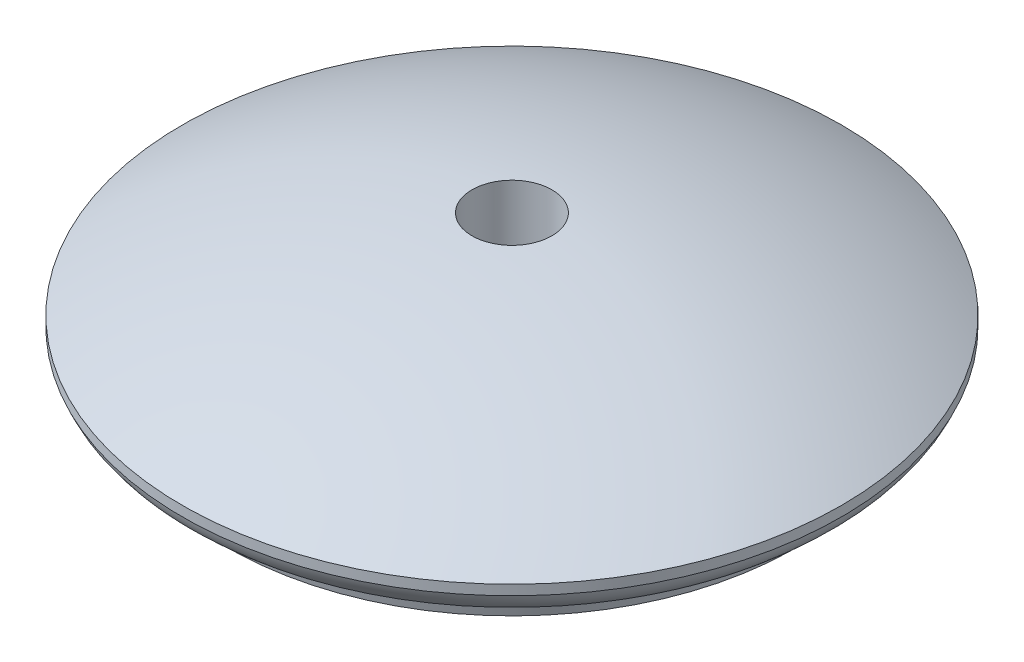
ISO-10303-21;
HEADER;
FILE_DESCRIPTION(('STEP AP214'),'2;1');
FILE_NAME('part.step','',(''),(''),'','','');
FILE_SCHEMA(('AUTOMOTIVE_DESIGN { 1 0 10303 214 1 1 1 1 }'));
ENDSEC;
DATA;
#1=APPLICATION_CONTEXT('core data for automotive mechanical design processes');
#2=APPLICATION_PROTOCOL_DEFINITION('international standard','automotive_design',2000,#1);
#3=PRODUCT_CONTEXT('',#1,'mechanical');
#4=PRODUCT('Part','Part','',(#3));
#5=PRODUCT_RELATED_PRODUCT_CATEGORY('part','',(#4));
#6=PRODUCT_DEFINITION_FORMATION('','',#4);
#7=PRODUCT_DEFINITION_CONTEXT('part definition',#1,'design');
#8=PRODUCT_DEFINITION('design','',#6,#7);
#9=PRODUCT_DEFINITION_SHAPE('','',#8);
#10=(LENGTH_UNIT() NAMED_UNIT(*) SI_UNIT(.MILLI.,.METRE.));
#11=(NAMED_UNIT(*) PLANE_ANGLE_UNIT() SI_UNIT($,.RADIAN.));
#12=(NAMED_UNIT(*) SI_UNIT($,.STERADIAN.) SOLID_ANGLE_UNIT());
#13=UNCERTAINTY_MEASURE_WITH_UNIT(LENGTH_MEASURE(1.E-05),#10,'distance_accuracy_value','');
#14=(GEOMETRIC_REPRESENTATION_CONTEXT(3) GLOBAL_UNCERTAINTY_ASSIGNED_CONTEXT((#13)) GLOBAL_UNIT_ASSIGNED_CONTEXT((#10,
#11,#12)) REPRESENTATION_CONTEXT('',''));
#15=CARTESIAN_POINT('',(0.,0.,0.));
#16=DIRECTION('',(0.,0.,1.));
#17=DIRECTION('',(1.,0.,0.));
#18=AXIS2_PLACEMENT_3D('',#15,#16,#17);
#19=CARTESIAN_POINT('',(0.,0.,0.));
#20=DIRECTION('',(0.,-1.,0.));
#21=DIRECTION('',(0.,0.,-1.));
#22=AXIS2_PLACEMENT_3D('',#19,#20,#21);
#23=CYLINDRICAL_SURFACE('',#22,20.);
#24=CARTESIAN_POINT('',(0.,10.,0.));
#25=DIRECTION('',(0.,-1.,0.));
#26=DIRECTION('',(0.,0.,-1.));
#27=AXIS2_PLACEMENT_3D('',#24,#25,#26);
#28=CIRCLE('',#27,20.);
#29=CARTESIAN_POINT('',(0.,10.,-20.));
#30=VERTEX_POINT('',#29);
#31=EDGE_CURVE('E10',#30,#30,#28,.T.);
#32=ORIENTED_EDGE('',*,*,#31,.T.);
#33=EDGE_LOOP('',(#32));
#34=FACE_BOUND('',#33,.T.);
#35=CARTESIAN_POINT('',(0.,74.3840316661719,0.));
#36=DIRECTION('',(0.,-1.,0.));
#37=DIRECTION('',(0.,0.,-1.));
#38=AXIS2_PLACEMENT_3D('',#35,#36,#37);
#39=CIRCLE('',#38,20.);
#40=CARTESIAN_POINT('',(19.9999999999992,74.3840316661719,0.));
#41=VERTEX_POINT('',#40);
#42=EDGE_CURVE('E59',#41,#41,#39,.T.);
#43=ORIENTED_EDGE('',*,*,#42,.F.);
#44=EDGE_LOOP('',(#43));
#45=FACE_BOUND('',#44,.T.);
#46=ADVANCED_FACE('F37',(#34,#45),#23,.F.);
#47=CARTESIAN_POINT('',(0.,10.,0.));
#48=DIRECTION('',(0.,-1.,0.));
#49=DIRECTION('',(0.,0.,-1.));
#50=AXIS2_PLACEMENT_3D('',#47,#48,#49);
#51=PLANE('',#50);
#52=ORIENTED_EDGE('',*,*,#31,.F.);
#53=EDGE_LOOP('',(#52));
#54=FACE_BOUND('',#53,.T.);
#55=ADVANCED_FACE('F67',(#54),#51,.F.);
#56=CARTESIAN_POINT('',(0.,0.,0.));
#57=DIRECTION('',(0.,-1.,0.));
#58=DIRECTION('',(0.,0.,-1.));
#59=AXIS2_PLACEMENT_3D('',#56,#57,#58);
#60=PLANE('',#59);
#61=CARTESIAN_POINT('',(0.,0.,0.));
#62=DIRECTION('',(0.,-1.,0.));
#63=DIRECTION('',(0.,0.,-1.));
#64=AXIS2_PLACEMENT_3D('',#61,#62,#63);
#65=CIRCLE('',#64,142.);
#66=CARTESIAN_POINT('',(0.,0.,-142.));
#67=VERTEX_POINT('',#66);
#68=EDGE_CURVE('E43',#67,#67,#65,.T.);
#69=ORIENTED_EDGE('',*,*,#68,.T.);
#70=EDGE_LOOP('',(#69));
#71=FACE_BOUND('',#70,.T.);
#72=ADVANCED_FACE('F71',(#71),#60,.T.);
#73=CARTESIAN_POINT('',(0.,0.,0.));
#74=DIRECTION('',(0.,1.,0.));
#75=DIRECTION('',(0.,0.,1.));
#76=AXIS2_PLACEMENT_3D('',#73,#74,#75);
#77=CONICAL_SURFACE('',#76,142.,0.17951645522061);
#78=CARTESIAN_POINT('',(0.,10.,0.));
#79=DIRECTION('',(0.,-1.,0.));
#80=DIRECTION('',(0.,0.,-1.));
#81=AXIS2_PLACEMENT_3D('',#78,#79,#80);
#82=CIRCLE('',#81,143.814700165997);
#83=CARTESIAN_POINT('',(0.,10.,-143.814700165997));
#84=VERTEX_POINT('',#83);
#85=EDGE_CURVE('E47',#84,#84,#82,.T.);
#86=ORIENTED_EDGE('',*,*,#85,.T.);
#87=EDGE_LOOP('',(#86));
#88=FACE_BOUND('',#87,.T.);
#89=ORIENTED_EDGE('',*,*,#68,.F.);
#90=EDGE_LOOP('',(#89));
#91=FACE_BOUND('',#90,.T.);
#92=ADVANCED_FACE('F76',(#88,#91),#77,.T.);
#93=CARTESIAN_POINT('',(0.,32.4605643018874,0.));
#94=DIRECTION('',(0.,-1.,0.));
#95=DIRECTION('',(0.,0.,-1.));
#96=AXIS2_PLACEMENT_3D('',#93,#94,#95);
#97=TOROIDAL_SURFACE('',#96,143.814700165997,22.4605643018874);
#98=CARTESIAN_POINT('',(0.,25.,0.));
#99=DIRECTION('',(0.,-1.,0.));
#100=DIRECTION('',(0.,0.,-1.));
#101=AXIS2_PLACEMENT_3D('',#98,#99,#100);
#102=CIRCLE('',#101,165.);
#103=CARTESIAN_POINT('',(0.,25.,-165.));
#104=VERTEX_POINT('',#103);
#105=EDGE_CURVE('E51',#104,#104,#102,.T.);
#106=ORIENTED_EDGE('',*,*,#105,.T.);
#107=EDGE_LOOP('',(#106));
#108=FACE_BOUND('',#107,.T.);
#109=ORIENTED_EDGE('',*,*,#85,.F.);
#110=EDGE_LOOP('',(#109));
#111=FACE_BOUND('',#110,.T.);
#112=ADVANCED_FACE('F81',(#108,#111),#97,.T.);
#113=CARTESIAN_POINT('',(0.,0.,0.));
#114=DIRECTION('',(0.,-1.,0.));
#115=DIRECTION('',(0.,0.,-1.));
#116=AXIS2_PLACEMENT_3D('',#113,#114,#115);
#117=CYLINDRICAL_SURFACE('',#116,165.);
#118=CARTESIAN_POINT('',(0.,30.,0.));
#119=DIRECTION('',(0.,-1.,0.));
#120=DIRECTION('',(0.,0.,-1.));
#121=AXIS2_PLACEMENT_3D('',#118,#119,#120);
#122=CIRCLE('',#121,165.);
#123=CARTESIAN_POINT('',(165.,30.,0.));
#124=VERTEX_POINT('',#123);
#125=EDGE_CURVE('E56',#124,#124,#122,.T.);
#126=ORIENTED_EDGE('',*,*,#125,.T.);
#127=EDGE_LOOP('',(#126));
#128=FACE_BOUND('',#127,.T.);
#129=ORIENTED_EDGE('',*,*,#105,.F.);
#130=EDGE_LOOP('',(#129));
#131=FACE_BOUND('',#130,.T.);
#132=ADVANCED_FACE('F85',(#128,#131),#117,.T.);
#133=CARTESIAN_POINT('',(0.,-250.,0.));
#134=DIRECTION('',(0.,-1.,0.));
#135=DIRECTION('',(1.,0.,0.));
#136=AXIS2_PLACEMENT_3D('',#133,#134,#135);
#137=SPHERICAL_SURFACE('',#136,325.);
#138=CARTESIAN_POINT('',(19.9999999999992,74.3840316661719,0.));
#139=CARTESIAN_POINT('',(21.5912616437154,74.2859228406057,0.));
#140=CARTESIAN_POINT('',(23.1818012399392,74.1761033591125,0.));
#141=CARTESIAN_POINT('',(26.3610921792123,73.9330708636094,0.));
#142=CARTESIAN_POINT('',(27.9498435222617,73.7998578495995,0.));
#143=CARTESIAN_POINT('',(31.1252137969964,73.5100660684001,0.));
#144=CARTESIAN_POINT('',(32.7118327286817,73.3534873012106,0.));
#145=CARTESIAN_POINT('',(35.8825945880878,73.0169982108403,0.));
#146=CARTESIAN_POINT('',(37.4667375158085,72.8370878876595,0.));
#147=CARTESIAN_POINT('',(40.6322042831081,72.4539745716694,0.));
#148=CARTESIAN_POINT('',(42.2135281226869,72.2507715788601,0.));
#149=CARTESIAN_POINT('',(45.3730142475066,71.8211169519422,0.));
#150=CARTESIAN_POINT('',(46.9511765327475,71.5946653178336,0.));
#151=CARTESIAN_POINT('',(50.1039977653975,71.1185624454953,0.));
#152=CARTESIAN_POINT('',(51.6786567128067,70.8689112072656,0.));
#153=CARTESIAN_POINT('',(54.8241302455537,70.3464631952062,0.));
#154=CARTESIAN_POINT('',(56.3949448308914,70.0736664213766,0.));
#155=CARTESIAN_POINT('',(59.5323894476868,69.5049864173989,0.));
#156=CARTESIAN_POINT('',(61.0990194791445,69.2091031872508,0.));
#157=CARTESIAN_POINT('',(64.2277557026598,68.594314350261,0.));
#158=CARTESIAN_POINT('',(65.7898618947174,68.2754087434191,0.));
#159=CARTESIAN_POINT('',(68.9092121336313,67.6146442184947,0.));
#160=CARTESIAN_POINT('',(70.4664561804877,67.272785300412,0.));
#161=CARTESIAN_POINT('',(73.5757448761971,66.5661881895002,0.));
#162=CARTESIAN_POINT('',(75.1277895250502,66.2014499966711,0.));
#163=CARTESIAN_POINT('',(78.2263432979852,65.4491733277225,0.));
#164=CARTESIAN_POINT('',(79.7728524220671,65.0616348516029,0.));
#165=CARTESIAN_POINT('',(82.8600002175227,64.263841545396,0.));
#166=CARTESIAN_POINT('',(84.4006388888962,63.8535867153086,0.));
#167=CARTESIAN_POINT('',(87.4757121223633,63.0104495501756,0.));
#168=CARTESIAN_POINT('',(89.0101466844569,62.57756721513,0.));
#169=CARTESIAN_POINT('',(92.0724793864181,61.6892687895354,0.));
#170=CARTESIAN_POINT('',(93.6003775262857,61.2338526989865,0.));
#171=CARTESIAN_POINT('',(96.649306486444,60.3005853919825,0.));
#172=CARTESIAN_POINT('',(98.1703373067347,59.8227341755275,0.));
#173=CARTESIAN_POINT('',(101.205202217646,58.8447001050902,0.));
#174=CARTESIAN_POINT('',(102.719036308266,58.3445172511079,0.));
#175=CARTESIAN_POINT('',(105.73917990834,57.3219282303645,0.));
#176=CARTESIAN_POINT('',(107.245489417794,56.7995220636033,0.));
#177=CARTESIAN_POINT('',(110.250257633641,55.7325995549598,0.));
#178=CARTESIAN_POINT('',(111.748716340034,55.1880832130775,0.));
#179=CARTESIAN_POINT('',(114.737458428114,54.0770582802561,0.));
#180=CARTESIAN_POINT('',(116.227741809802,53.510549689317,0.));
#181=CARTESIAN_POINT('',(119.199810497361,52.3556629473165,0.));
#182=CARTESIAN_POINT('',(120.681595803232,51.7672847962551,0.));
#183=CARTESIAN_POINT('',(123.636347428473,50.5687863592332,0.));
#184=CARTESIAN_POINT('',(125.109313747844,49.9586660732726,0.));
#185=CARTESIAN_POINT('',(128.046108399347,48.7168155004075,0.));
#186=CARTESIAN_POINT('',(129.50993673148,48.085085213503,0.));
#187=CARTESIAN_POINT('',(132.428138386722,46.800151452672,0.));
#188=CARTESIAN_POINT('',(133.882511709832,46.1469479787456,0.));
#189=CARTESIAN_POINT('',(136.781488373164,44.8192093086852,0.));
#190=CARTESIAN_POINT('',(138.226091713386,44.1446741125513,0.));
#191=CARTESIAN_POINT('',(141.105215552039,42.7744180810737,0.));
#192=CARTESIAN_POINT('',(142.539736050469,42.0786972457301,0.));
#193=CARTESIAN_POINT('',(145.398383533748,40.6662206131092,0.));
#194=CARTESIAN_POINT('',(146.822510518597,39.9494648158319,0.));
#195=CARTESIAN_POINT('',(149.66006254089,38.4950734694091,0.));
#196=CARTESIAN_POINT('',(151.073487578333,37.7574379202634,0.));
#197=CARTESIAN_POINT('',(153.889329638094,36.2614468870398,0.));
#198=CARTESIAN_POINT('',(155.291746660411,35.5030914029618,0.));
#199=CARTESIAN_POINT('',(158.085268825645,33.9658244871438,0.));
#200=CARTESIAN_POINT('',(159.476373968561,33.1869130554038,0.));
#201=CARTESIAN_POINT('',(162.246971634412,31.6087038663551,0.));
#202=CARTESIAN_POINT('',(163.626464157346,30.8094061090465,0.));
#203=CARTESIAN_POINT('',(165.,30.,0.));
#204=B_SPLINE_CURVE_WITH_KNOTS('',3,(#138,#139,#140,#141,#142,#143,#144,#145,#146,#147,#148,
#149,#150,#151,#152,#153,#154,#155,#156,#157,#158,#159,#160,#161,#162,#163,#164,#165,#166,#167,
#168,#169,#170,#171,#172,#173,#174,#175,#176,#177,#178,#179,#180,#181,#182,#183,#184,#185,#186,
#187,#188,#189,#190,#191,#192,#193,#194,#195,#196,#197,#198,#199,#200,#201,#202,#203),
.UNSPECIFIED.,.F.,.F.,(4,2,2,2,2,2,2,2,2,2,2,2,2,2,2,2,2,2,2,2,2,2,2,2,2,2,2,2,2,2,2,2,4),(0.,
4.78280643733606,9.56561287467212,14.3484193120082,19.1312257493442,23.9140321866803,
28.6968386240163,33.4796450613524,38.2624514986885,43.0452579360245,47.8280643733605,
52.6108708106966,57.3936772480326,62.1764836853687,66.9592901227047,71.7420965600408,
76.5249029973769,81.3077094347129,86.090515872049,90.873322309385,95.6561287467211,
100.438935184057,105.221741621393,110.004548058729,114.787354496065,119.570160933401,
124.352967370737,129.135773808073,133.918580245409,138.701386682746,143.484193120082,
148.266999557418,153.049805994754),.UNSPECIFIED.);
#205=EDGE_CURVE('BSEAM63',#41,#124,#204,.T.);
#206=ORIENTED_EDGE('',*,*,#42,.T.);
#207=ORIENTED_EDGE('',*,*,#125,.F.);
#208=ORIENTED_EDGE('',*,*,#205,.T.);
#209=ORIENTED_EDGE('',*,*,#205,.F.);
#210=EDGE_LOOP('',(#206,#208,#207,#209));
#211=FACE_BOUND('',#210,.T.);
#212=ADVANCED_FACE('F63',(#211),#137,.T.);
#213=CLOSED_SHELL('',(#46,#55,#72,#92,#112,#132,#212));
#214=MANIFOLD_SOLID_BREP('B2',#213);
#215=ADVANCED_BREP_SHAPE_REPRESENTATION('',(#18,#214),#14);
#216=SHAPE_DEFINITION_REPRESENTATION(#9,#215);
ENDSEC;
END-ISO-10303-21;
